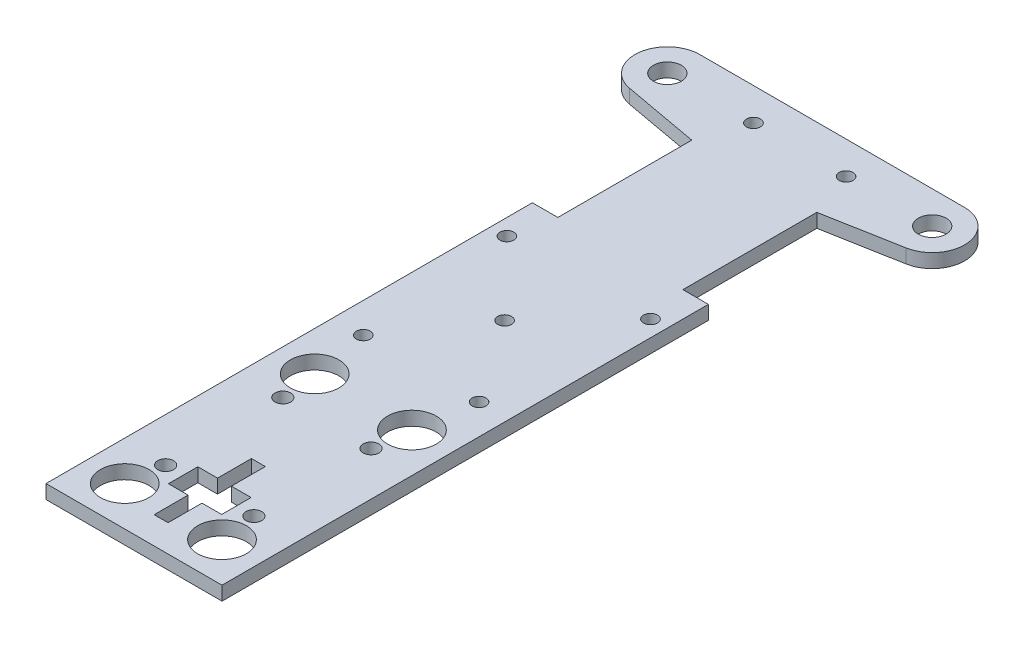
ISO-10303-21;
HEADER;
FILE_DESCRIPTION(('STEP AP214'),'2;1');
FILE_NAME('part.step','',(''),(''),'','','');
FILE_SCHEMA(('AUTOMOTIVE_DESIGN { 1 0 10303 214 1 1 1 1 }'));
ENDSEC;
DATA;
#1=APPLICATION_CONTEXT('core data for automotive mechanical design processes');
#2=APPLICATION_PROTOCOL_DEFINITION('international standard','automotive_design',2000,#1);
#3=PRODUCT_CONTEXT('',#1,'mechanical');
#4=PRODUCT('Part','Part','',(#3));
#5=PRODUCT_RELATED_PRODUCT_CATEGORY('part','',(#4));
#6=PRODUCT_DEFINITION_FORMATION('','',#4);
#7=PRODUCT_DEFINITION_CONTEXT('part definition',#1,'design');
#8=PRODUCT_DEFINITION('design','',#6,#7);
#9=PRODUCT_DEFINITION_SHAPE('','',#8);
#10=(LENGTH_UNIT() NAMED_UNIT(*) SI_UNIT(.MILLI.,.METRE.));
#11=(NAMED_UNIT(*) PLANE_ANGLE_UNIT() SI_UNIT($,.RADIAN.));
#12=(NAMED_UNIT(*) SI_UNIT($,.STERADIAN.) SOLID_ANGLE_UNIT());
#13=UNCERTAINTY_MEASURE_WITH_UNIT(LENGTH_MEASURE(1.E-05),#10,'distance_accuracy_value','');
#14=(GEOMETRIC_REPRESENTATION_CONTEXT(3) GLOBAL_UNCERTAINTY_ASSIGNED_CONTEXT((#13)) GLOBAL_UNIT_ASSIGNED_CONTEXT((#10,
#11,#12)) REPRESENTATION_CONTEXT('',''));
#15=CARTESIAN_POINT('',(0.,0.,0.));
#16=DIRECTION('',(0.,0.,1.));
#17=DIRECTION('',(1.,0.,0.));
#18=AXIS2_PLACEMENT_3D('',#15,#16,#17);
#19=CARTESIAN_POINT('',(0.,0.,-102.));
#20=DIRECTION('',(0.,0.,-1.));
#21=DIRECTION('',(-1.,0.,0.));
#22=AXIS2_PLACEMENT_3D('',#19,#20,#21);
#23=PLANE('',#22);
#24=DIRECTION('',(-1.,0.,0.));
#25=VECTOR('',#24,1.);
#26=CARTESIAN_POINT('',(32.,0.,-102.));
#27=LINE('',#26,#25);
#28=CARTESIAN_POINT('',(35.,0.,-102.));
#29=VERTEX_POINT('',#28);
#30=CARTESIAN_POINT('',(29.5,0.,-102.));
#31=VERTEX_POINT('',#30);
#32=EDGE_CURVE('E447',#29,#31,#27,.T.);
#33=ORIENTED_EDGE('',*,*,#32,.T.);
#34=DIRECTION('',(0.,1.,0.));
#35=VECTOR('',#34,1.);
#36=CARTESIAN_POINT('',(29.5,-36.7967389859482,-102.));
#37=LINE('',#36,#35);
#38=CARTESIAN_POINT('',(29.5,3.,-102.));
#39=VERTEX_POINT('',#38);
#40=EDGE_CURVE('E316',#31,#39,#37,.T.);
#41=ORIENTED_EDGE('',*,*,#40,.T.);
#42=DIRECTION('',(1.,0.,0.));
#43=VECTOR('',#42,1.);
#44=CARTESIAN_POINT('',(0.,3.,-102.));
#45=LINE('',#44,#43);
#46=CARTESIAN_POINT('',(35.,3.,-102.));
#47=VERTEX_POINT('',#46);
#48=EDGE_CURVE('E449',#39,#47,#45,.T.);
#49=ORIENTED_EDGE('',*,*,#48,.T.);
#50=DIRECTION('',(0.,-1.,0.));
#51=VECTOR('',#50,1.);
#52=CARTESIAN_POINT('',(35.,0.,-102.));
#53=LINE('',#52,#51);
#54=EDGE_CURVE('E319',#47,#29,#53,.T.);
#55=ORIENTED_EDGE('',*,*,#54,.T.);
#56=EDGE_LOOP('',(#33,#41,#49,#55));
#57=FACE_BOUND('',#56,.T.);
#58=ADVANCED_FACE('F35',(#57),#23,.T.);
#59=CARTESIAN_POINT('',(10.25,0.,-16.5273947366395));
#60=DIRECTION('',(0.,0.,-1.));
#61=DIRECTION('',(-1.,0.,0.));
#62=AXIS2_PLACEMENT_3D('',#59,#60,#61);
#63=PLANE('',#62);
#64=DIRECTION('',(-1.,0.,0.));
#65=VECTOR('',#64,1.);
#66=CARTESIAN_POINT('',(10.25,0.,-16.5273947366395));
#67=LINE('',#66,#65);
#68=CARTESIAN_POINT('',(14.5,0.,-16.5273947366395));
#69=VERTEX_POINT('',#68);
#70=CARTESIAN_POINT('',(10.25,0.,-16.5273947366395));
#71=VERTEX_POINT('',#70);
#72=EDGE_CURVE('E418',#69,#71,#67,.T.);
#73=ORIENTED_EDGE('',*,*,#72,.F.);
#74=DIRECTION('',(0.,1.,0.));
#75=VECTOR('',#74,1.);
#76=CARTESIAN_POINT('',(14.5,0.,-16.5273947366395));
#77=LINE('',#76,#75);
#78=CARTESIAN_POINT('',(14.5,3.,-16.5273947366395));
#79=VERTEX_POINT('',#78);
#80=EDGE_CURVE('E392',#69,#79,#77,.T.);
#81=ORIENTED_EDGE('',*,*,#80,.T.);
#82=DIRECTION('',(-1.,0.,0.));
#83=VECTOR('',#82,1.);
#84=CARTESIAN_POINT('',(0.,3.,-16.5273947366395));
#85=LINE('',#84,#83);
#86=CARTESIAN_POINT('',(10.25,3.,-16.5273947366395));
#87=VERTEX_POINT('',#86);
#88=EDGE_CURVE('E439',#79,#87,#85,.T.);
#89=ORIENTED_EDGE('',*,*,#88,.T.);
#90=DIRECTION('',(0.,1.,0.));
#91=VECTOR('',#90,1.);
#92=CARTESIAN_POINT('',(10.25,0.,-16.5273947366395));
#93=LINE('',#92,#91);
#94=EDGE_CURVE('E423',#71,#87,#93,.T.);
#95=ORIENTED_EDGE('',*,*,#94,.F.);
#96=EDGE_LOOP('',(#73,#81,#89,#95));
#97=FACE_BOUND('',#96,.T.);
#98=ADVANCED_FACE('F499',(#97),#63,.F.);
#99=CARTESIAN_POINT('',(10.25,0.,-10.1773947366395));
#100=DIRECTION('',(0.,0.,1.));
#101=DIRECTION('',(1.,0.,0.));
#102=AXIS2_PLACEMENT_3D('',#99,#100,#101);
#103=PLANE('',#102);
#104=DIRECTION('',(1.,0.,0.));
#105=VECTOR('',#104,1.);
#106=CARTESIAN_POINT('',(0.,3.,-10.1773947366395));
#107=LINE('',#106,#105);
#108=CARTESIAN_POINT('',(10.25,3.,-10.1773947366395));
#109=VERTEX_POINT('',#108);
#110=CARTESIAN_POINT('',(14.5,3.,-10.1773947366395));
#111=VERTEX_POINT('',#110);
#112=EDGE_CURVE('E434',#109,#111,#107,.T.);
#113=ORIENTED_EDGE('',*,*,#112,.T.);
#114=DIRECTION('',(0.,-1.,0.));
#115=VECTOR('',#114,1.);
#116=CARTESIAN_POINT('',(14.5,0.,-10.1773947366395));
#117=LINE('',#116,#115);
#118=CARTESIAN_POINT('',(14.5,0.,-10.1773947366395));
#119=VERTEX_POINT('',#118);
#120=EDGE_CURVE('E12',#111,#119,#117,.T.);
#121=ORIENTED_EDGE('',*,*,#120,.T.);
#122=DIRECTION('',(1.,0.,0.));
#123=VECTOR('',#122,1.);
#124=CARTESIAN_POINT('',(10.25,0.,-10.1773947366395));
#125=LINE('',#124,#123);
#126=CARTESIAN_POINT('',(10.25,0.,-10.1773947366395));
#127=VERTEX_POINT('',#126);
#128=EDGE_CURVE('E412',#127,#119,#125,.T.);
#129=ORIENTED_EDGE('',*,*,#128,.F.);
#130=DIRECTION('',(0.,1.,0.));
#131=VECTOR('',#130,1.);
#132=CARTESIAN_POINT('',(10.25,0.,-10.1773947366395));
#133=LINE('',#132,#131);
#134=EDGE_CURVE('E422',#127,#109,#133,.T.);
#135=ORIENTED_EDGE('',*,*,#134,.T.);
#136=EDGE_LOOP('',(#113,#121,#129,#135));
#137=FACE_BOUND('',#136,.T.);
#138=ADVANCED_FACE('F489',(#137),#103,.F.);
#139=CARTESIAN_POINT('',(0.,3.,0.));
#140=DIRECTION('',(0.,1.,0.));
#141=DIRECTION('',(0.,0.,1.));
#142=AXIS2_PLACEMENT_3D('',#139,#140,#141);
#143=PLANE('',#142);
#144=CARTESIAN_POINT('',(5.5,3.,-5.50000000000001));
#145=DIRECTION('',(0.,1.,0.));
#146=DIRECTION('',(0.,0.,1.));
#147=AXIS2_PLACEMENT_3D('',#144,#145,#146);
#148=CIRCLE('',#147,5.25);
#149=CARTESIAN_POINT('',(5.5,3.,-0.250000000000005));
#150=VERTEX_POINT('',#149);
#151=EDGE_CURVE('E225',#150,#150,#148,.T.);
#152=ORIENTED_EDGE('',*,*,#151,.F.);
#153=EDGE_LOOP('',(#152));
#154=FACE_BOUND('',#153,.T.);
#155=CARTESIAN_POINT('',(26.5,3.,-5.50000000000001));
#156=DIRECTION('',(0.,1.,0.));
#157=DIRECTION('',(0.,0.,1.));
#158=AXIS2_PLACEMENT_3D('',#155,#156,#157);
#159=CIRCLE('',#158,5.25);
#160=CARTESIAN_POINT('',(26.5,3.,-0.250000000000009));
#161=VERTEX_POINT('',#160);
#162=EDGE_CURVE('E229',#161,#161,#159,.T.);
#163=ORIENTED_EDGE('',*,*,#162,.F.);
#164=EDGE_LOOP('',(#163));
#165=FACE_BOUND('',#164,.T.);
#166=CARTESIAN_POINT('',(26.5,3.,-46.5));
#167=DIRECTION('',(0.,1.,0.));
#168=DIRECTION('',(0.,0.,1.));
#169=AXIS2_PLACEMENT_3D('',#166,#167,#168);
#170=CIRCLE('',#169,5.25);
#171=CARTESIAN_POINT('',(26.5,3.,-41.25));
#172=VERTEX_POINT('',#171);
#173=EDGE_CURVE('E678',#172,#172,#170,.T.);
#174=ORIENTED_EDGE('',*,*,#173,.F.);
#175=EDGE_LOOP('',(#174));
#176=FACE_BOUND('',#175,.T.);
#177=CARTESIAN_POINT('',(5.5,3.,-46.5));
#178=DIRECTION('',(0.,1.,0.));
#179=DIRECTION('',(0.,0.,1.));
#180=AXIS2_PLACEMENT_3D('',#177,#178,#179);
#181=CIRCLE('',#180,5.25);
#182=CARTESIAN_POINT('',(5.5,3.,-41.25));
#183=VERTEX_POINT('',#182);
#184=EDGE_CURVE('E680',#183,#183,#181,.T.);
#185=ORIENTED_EDGE('',*,*,#184,.F.);
#186=EDGE_LOOP('',(#185));
#187=FACE_BOUND('',#186,.T.);
#188=DIRECTION('',(0.,0.,-1.));
#189=VECTOR('',#188,1.);
#190=CARTESIAN_POINT('',(-3.,3.,-102.));
#191=LINE('',#190,#189);
#192=CARTESIAN_POINT('',(-3.,3.,3.));
#193=VERTEX_POINT('',#192);
#194=CARTESIAN_POINT('',(-3.,3.,-102.));
#195=VERTEX_POINT('',#194);
#196=EDGE_CURVE('E212',#193,#195,#191,.T.);
#197=ORIENTED_EDGE('',*,*,#196,.F.);
#198=DIRECTION('',(1.,0.,0.));
#199=VECTOR('',#198,1.);
#200=CARTESIAN_POINT('',(35.,3.,3.));
#201=LINE('',#200,#199);
#202=CARTESIAN_POINT('',(35.,3.,3.));
#203=VERTEX_POINT('',#202);
#204=EDGE_CURVE('E198',#193,#203,#201,.T.);
#205=ORIENTED_EDGE('',*,*,#204,.T.);
#206=DIRECTION('',(0.,0.,-1.));
#207=VECTOR('',#206,1.);
#208=CARTESIAN_POINT('',(35.,3.,-102.));
#209=LINE('',#208,#207);
#210=EDGE_CURVE('E328',#203,#47,#209,.T.);
#211=ORIENTED_EDGE('',*,*,#210,.T.);
#212=ORIENTED_EDGE('',*,*,#48,.F.);
#213=DIRECTION('',(0.,0.,-1.));
#214=VECTOR('',#213,1.);
#215=CARTESIAN_POINT('',(29.5,3.,-102.));
#216=LINE('',#215,#214);
#217=CARTESIAN_POINT('',(29.5,3.,-130.910855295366));
#218=VERTEX_POINT('',#217);
#219=EDGE_CURVE('E321',#39,#218,#216,.T.);
#220=ORIENTED_EDGE('',*,*,#219,.T.);
#221=DIRECTION('',(0.983652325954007,0.,-0.180078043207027));
#222=VECTOR('',#221,1.);
#223=CARTESIAN_POINT('',(29.5,3.,-130.910855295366));
#224=LINE('',#223,#222);
#225=CARTESIAN_POINT('',(45.7980576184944,3.,-133.894554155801));
#226=VERTEX_POINT('',#225);
#227=EDGE_CURVE('E263',#218,#226,#224,.T.);
#228=ORIENTED_EDGE('',*,*,#227,.T.);
#229=CARTESIAN_POINT('',(44.5375112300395,3.,-140.780120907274));
#230=DIRECTION('',(0.,1.,0.));
#231=DIRECTION('',(0.,0.,1.));
#232=AXIS2_PLACEMENT_3D('',#229,#230,#231);
#233=CIRCLE('',#232,7.00000047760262);
#234=CARTESIAN_POINT('',(44.5375112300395,3.,-147.780121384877));
#235=VERTEX_POINT('',#234);
#236=EDGE_CURVE('E266',#226,#235,#233,.T.);
#237=ORIENTED_EDGE('',*,*,#236,.T.);
#238=DIRECTION('',(-1.,0.,0.));
#239=VECTOR('',#238,1.);
#240=CARTESIAN_POINT('',(-12.6398663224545,3.,-147.780121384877));
#241=LINE('',#240,#239);
#242=CARTESIAN_POINT('',(-12.6398663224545,3.,-147.780121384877));
#243=VERTEX_POINT('',#242);
#244=EDGE_CURVE('E269',#235,#243,#241,.T.);
#245=ORIENTED_EDGE('',*,*,#244,.T.);
#246=CARTESIAN_POINT('',(-12.6398663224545,3.,-140.780121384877));
#247=DIRECTION('',(0.,1.,0.));
#248=DIRECTION('',(0.,0.,1.));
#249=AXIS2_PLACEMENT_3D('',#246,#247,#248);
#250=CIRCLE('',#249,7.00000000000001);
#251=CARTESIAN_POINT('',(-13.892796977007,3.,-133.893165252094));
#252=VERTEX_POINT('',#251);
#253=EDGE_CURVE('E245',#243,#252,#250,.T.);
#254=ORIENTED_EDGE('',*,*,#253,.T.);
#255=DIRECTION('',(0.983850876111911,0.,0.178990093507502));
#256=VECTOR('',#255,1.);
#257=CARTESIAN_POINT('',(-13.892796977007,3.,-133.893165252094));
#258=LINE('',#257,#256);
#259=CARTESIAN_POINT('',(2.5,3.,-130.910855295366));
#260=VERTEX_POINT('',#259);
#261=EDGE_CURVE('E260',#252,#260,#258,.T.);
#262=ORIENTED_EDGE('',*,*,#261,.T.);
#263=DIRECTION('',(0.,0.,1.));
#264=VECTOR('',#263,1.);
#265=CARTESIAN_POINT('',(2.5,3.,-102.));
#266=LINE('',#265,#264);
#267=CARTESIAN_POINT('',(2.5,3.,-102.));
#268=VERTEX_POINT('',#267);
#269=EDGE_CURVE('E311',#260,#268,#266,.T.);
#270=ORIENTED_EDGE('',*,*,#269,.T.);
#271=EDGE_CURVE('E215',#195,#268,#45,.T.);
#272=ORIENTED_EDGE('',*,*,#271,.F.);
#273=EDGE_LOOP('',(#197,#205,#211,#212,#220,#228,#237,#245,#254,#262,#270,#272));
#274=FACE_BOUND('',#273,.T.);
#275=CARTESIAN_POINT('',(5.94991125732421,3.,-140.780133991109));
#276=DIRECTION('',(0.,1.,0.));
#277=DIRECTION('',(0.,0.,1.));
#278=AXIS2_PLACEMENT_3D('',#275,#276,#277);
#279=CIRCLE('',#278,1.5);
#280=CARTESIAN_POINT('',(5.94991125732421,3.,-139.280133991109));
#281=VERTEX_POINT('',#280);
#282=EDGE_CURVE('E242',#281,#281,#279,.T.);
#283=ORIENTED_EDGE('',*,*,#282,.F.);
#284=EDGE_LOOP('',(#283));
#285=FACE_BOUND('',#284,.T.);
#286=CARTESIAN_POINT('',(25.9499112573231,3.,-140.780127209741));
#287=DIRECTION('',(0.,1.,0.));
#288=DIRECTION('',(0.,0.,1.));
#289=AXIS2_PLACEMENT_3D('',#286,#287,#288);
#290=CIRCLE('',#289,1.49999999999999);
#291=CARTESIAN_POINT('',(25.9499112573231,3.,-139.280127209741));
#292=VERTEX_POINT('',#291);
#293=EDGE_CURVE('E237',#292,#292,#290,.T.);
#294=ORIENTED_EDGE('',*,*,#293,.F.);
#295=EDGE_LOOP('',(#294));
#296=FACE_BOUND('',#295,.T.);
#297=CARTESIAN_POINT('',(31.5,3.,-93.));
#298=DIRECTION('',(0.,1.,0.));
#299=DIRECTION('',(0.,0.,1.));
#300=AXIS2_PLACEMENT_3D('',#297,#298,#299);
#301=CIRCLE('',#300,1.5);
#302=CARTESIAN_POINT('',(31.5,3.,-91.5));
#303=VERTEX_POINT('',#302);
#304=EDGE_CURVE('E298',#303,#303,#301,.T.);
#305=ORIENTED_EDGE('',*,*,#304,.F.);
#306=EDGE_LOOP('',(#305));
#307=FACE_BOUND('',#306,.T.);
#308=CARTESIAN_POINT('',(16.,3.,-77.));
#309=DIRECTION('',(0.,1.,0.));
#310=DIRECTION('',(0.,0.,1.));
#311=AXIS2_PLACEMENT_3D('',#308,#309,#310);
#312=CIRCLE('',#311,1.5);
#313=CARTESIAN_POINT('',(16.,3.,-75.5));
#314=VERTEX_POINT('',#313);
#315=EDGE_CURVE('E295',#314,#314,#312,.T.);
#316=ORIENTED_EDGE('',*,*,#315,.F.);
#317=EDGE_LOOP('',(#316));
#318=FACE_BOUND('',#317,.T.);
#319=CARTESIAN_POINT('',(0.5,3.,-93.));
#320=DIRECTION('',(0.,1.,0.));
#321=DIRECTION('',(0.,0.,1.));
#322=AXIS2_PLACEMENT_3D('',#319,#320,#321);
#323=CIRCLE('',#322,1.50000000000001);
#324=CARTESIAN_POINT('',(0.5,3.,-91.5));
#325=VERTEX_POINT('',#324);
#326=EDGE_CURVE('E287',#325,#325,#323,.T.);
#327=ORIENTED_EDGE('',*,*,#326,.F.);
#328=EDGE_LOOP('',(#327));
#329=FACE_BOUND('',#328,.T.);
#330=CARTESIAN_POINT('',(3.5,3.,-59.));
#331=DIRECTION('',(0.,1.,0.));
#332=DIRECTION('',(0.,0.,1.));
#333=AXIS2_PLACEMENT_3D('',#330,#331,#332);
#334=CIRCLE('',#333,1.5);
#335=CARTESIAN_POINT('',(3.5,3.,-57.5));
#336=VERTEX_POINT('',#335);
#337=EDGE_CURVE('E343',#336,#336,#334,.T.);
#338=ORIENTED_EDGE('',*,*,#337,.F.);
#339=EDGE_LOOP('',(#338));
#340=FACE_BOUND('',#339,.T.);
#341=CARTESIAN_POINT('',(28.5,3.,-59.));
#342=DIRECTION('',(0.,1.,0.));
#343=DIRECTION('',(0.,0.,1.));
#344=AXIS2_PLACEMENT_3D('',#341,#342,#343);
#345=CIRCLE('',#344,1.5);
#346=CARTESIAN_POINT('',(28.5,3.,-57.5));
#347=VERTEX_POINT('',#346);
#348=EDGE_CURVE('E338',#347,#347,#345,.T.);
#349=ORIENTED_EDGE('',*,*,#348,.F.);
#350=EDGE_LOOP('',(#349));
#351=FACE_BOUND('',#350,.T.);
#352=CARTESIAN_POINT('',(25.525,3.,-38.6476052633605));
#353=DIRECTION('',(0.,1.,0.));
#354=DIRECTION('',(0.,0.,1.));
#355=AXIS2_PLACEMENT_3D('',#352,#353,#354);
#356=CIRCLE('',#355,1.69999999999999);
#357=CARTESIAN_POINT('',(25.525,3.,-36.9476052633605));
#358=VERTEX_POINT('',#357);
#359=EDGE_CURVE('E355',#358,#358,#356,.T.);
#360=ORIENTED_EDGE('',*,*,#359,.F.);
#361=EDGE_LOOP('',(#360));
#362=FACE_BOUND('',#361,.T.);
#363=CARTESIAN_POINT('',(6.47499999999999,3.,-38.6476052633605));
#364=DIRECTION('',(0.,1.,0.));
#365=DIRECTION('',(0.,0.,1.));
#366=AXIS2_PLACEMENT_3D('',#363,#364,#365);
#367=CIRCLE('',#366,1.69999999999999);
#368=CARTESIAN_POINT('',(6.47499999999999,3.,-36.9476052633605));
#369=VERTEX_POINT('',#368);
#370=EDGE_CURVE('E352',#369,#369,#367,.T.);
#371=ORIENTED_EDGE('',*,*,#370,.F.);
#372=EDGE_LOOP('',(#371));
#373=FACE_BOUND('',#372,.T.);
#374=DIRECTION('',(0.,0.,1.));
#375=VECTOR('',#374,1.);
#376=CARTESIAN_POINT('',(14.5,3.,0.));
#377=LINE('',#376,#375);
#378=CARTESIAN_POINT('',(14.5,3.,-23.8523947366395));
#379=VERTEX_POINT('',#378);
#380=EDGE_CURVE('E393',#379,#79,#377,.T.);
#381=ORIENTED_EDGE('',*,*,#380,.F.);
#382=DIRECTION('',(-1.,0.,0.));
#383=VECTOR('',#382,1.);
#384=CARTESIAN_POINT('',(0.,3.,-23.8523947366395));
#385=LINE('',#384,#383);
#386=CARTESIAN_POINT('',(17.5,3.,-23.8523947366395));
#387=VERTEX_POINT('',#386);
#388=EDGE_CURVE('E398',#387,#379,#385,.T.);
#389=ORIENTED_EDGE('',*,*,#388,.F.);
#390=DIRECTION('',(0.,0.,-1.));
#391=VECTOR('',#390,1.);
#392=CARTESIAN_POINT('',(17.5,3.,0.));
#393=LINE('',#392,#391);
#394=CARTESIAN_POINT('',(17.5,3.,-16.5273947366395));
#395=VERTEX_POINT('',#394);
#396=EDGE_CURVE('E387',#395,#387,#393,.T.);
#397=ORIENTED_EDGE('',*,*,#396,.F.);
#398=CARTESIAN_POINT('',(21.75,3.,-16.5273947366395));
#399=VERTEX_POINT('',#398);
#400=EDGE_CURVE('E440',#399,#395,#85,.T.);
#401=ORIENTED_EDGE('',*,*,#400,.F.);
#402=DIRECTION('',(0.,0.,-1.));
#403=VECTOR('',#402,1.);
#404=CARTESIAN_POINT('',(21.75,3.,0.));
#405=LINE('',#404,#403);
#406=CARTESIAN_POINT('',(21.75,3.,-10.1773947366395));
#407=VERTEX_POINT('',#406);
#408=EDGE_CURVE('E437',#407,#399,#405,.T.);
#409=ORIENTED_EDGE('',*,*,#408,.F.);
#410=CARTESIAN_POINT('',(17.5,3.,-10.1773947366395));
#411=VERTEX_POINT('',#410);
#412=EDGE_CURVE('E426',#411,#407,#107,.T.);
#413=ORIENTED_EDGE('',*,*,#412,.F.);
#414=CARTESIAN_POINT('',(17.5,3.,-2.85239473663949));
#415=VERTEX_POINT('',#414);
#416=EDGE_CURVE('E376',#415,#411,#393,.T.);
#417=ORIENTED_EDGE('',*,*,#416,.F.);
#418=DIRECTION('',(1.,0.,0.));
#419=VECTOR('',#418,1.);
#420=CARTESIAN_POINT('',(0.,3.,-2.85239473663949));
#421=LINE('',#420,#419);
#422=CARTESIAN_POINT('',(14.5,3.,-2.85239473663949));
#423=VERTEX_POINT('',#422);
#424=EDGE_CURVE('E396',#423,#415,#421,.T.);
#425=ORIENTED_EDGE('',*,*,#424,.F.);
#426=EDGE_CURVE('E390',#111,#423,#377,.T.);
#427=ORIENTED_EDGE('',*,*,#426,.F.);
#428=ORIENTED_EDGE('',*,*,#112,.F.);
#429=DIRECTION('',(0.,0.,1.));
#430=VECTOR('',#429,1.);
#431=CARTESIAN_POINT('',(10.25,3.,0.));
#432=LINE('',#431,#430);
#433=EDGE_CURVE('E443',#87,#109,#432,.T.);
#434=ORIENTED_EDGE('',*,*,#433,.F.);
#435=ORIENTED_EDGE('',*,*,#88,.F.);
#436=EDGE_LOOP('',(#381,#389,#397,#401,#409,#413,#417,#425,#427,#428,#434,#435));
#437=FACE_BOUND('',#436,.T.);
#438=CARTESIAN_POINT('',(25.525,3.,-13.3523947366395));
#439=DIRECTION('',(0.,-1.,0.));
#440=DIRECTION('',(0.,0.,-1.));
#441=AXIS2_PLACEMENT_3D('',#438,#439,#440);
#442=CIRCLE('',#441,1.69999999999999);
#443=CARTESIAN_POINT('',(25.525,3.,-15.0523947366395));
#444=VERTEX_POINT('',#443);
#445=EDGE_CURVE('E401',#444,#444,#442,.T.);
#446=ORIENTED_EDGE('',*,*,#445,.T.);
#447=EDGE_LOOP('',(#446));
#448=FACE_BOUND('',#447,.T.);
#449=CARTESIAN_POINT('',(6.47499999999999,3.,-13.3523947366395));
#450=DIRECTION('',(0.,-1.,0.));
#451=DIRECTION('',(0.,0.,-1.));
#452=AXIS2_PLACEMENT_3D('',#449,#450,#451);
#453=CIRCLE('',#452,1.69999999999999);
#454=CARTESIAN_POINT('',(6.47499999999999,3.,-15.0523947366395));
#455=VERTEX_POINT('',#454);
#456=EDGE_CURVE('E400',#455,#455,#453,.T.);
#457=ORIENTED_EDGE('',*,*,#456,.T.);
#458=EDGE_LOOP('',(#457));
#459=FACE_BOUND('',#458,.T.);
#460=CARTESIAN_POINT('',(-12.6398663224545,3.,-140.780121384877));
#461=DIRECTION('',(0.,1.,0.));
#462=DIRECTION('',(0.,0.,1.));
#463=AXIS2_PLACEMENT_3D('',#460,#461,#462);
#464=CIRCLE('',#463,3.00000000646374);
#465=CARTESIAN_POINT('',(-12.6398663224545,3.,-137.780121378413));
#466=VERTEX_POINT('',#465);
#467=EDGE_CURVE('E308',#466,#466,#464,.F.);
#468=ORIENTED_EDGE('',*,*,#467,.T.);
#469=EDGE_LOOP('',(#468));
#470=FACE_BOUND('',#469,.T.);
#471=CARTESIAN_POINT('',(44.5375112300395,3.,-140.780120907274));
#472=DIRECTION('',(0.,1.,0.));
#473=DIRECTION('',(0.,0.,1.));
#474=AXIS2_PLACEMENT_3D('',#471,#472,#473);
#475=CIRCLE('',#474,3.00000000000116);
#476=CARTESIAN_POINT('',(44.5375112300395,3.,-137.780120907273));
#477=VERTEX_POINT('',#476);
#478=EDGE_CURVE('E307',#477,#477,#475,.F.);
#479=ORIENTED_EDGE('',*,*,#478,.T.);
#480=EDGE_LOOP('',(#479));
#481=FACE_BOUND('',#480,.T.);
#482=ADVANCED_FACE('F213',(#154,#165,#176,#187,#274,#285,#296,#307,#318,#329,#340,#351,#362,
#373,#437,#448,#459,#470,#481),#143,.T.);
#483=CARTESIAN_POINT('',(0.,0.,0.));
#484=DIRECTION('',(0.,1.,0.));
#485=DIRECTION('',(0.,0.,1.));
#486=AXIS2_PLACEMENT_3D('',#483,#484,#485);
#487=PLANE('',#486);
#488=CARTESIAN_POINT('',(5.5,0.,-5.50000000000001));
#489=DIRECTION('',(0.,1.,0.));
#490=DIRECTION('',(0.,0.,1.));
#491=AXIS2_PLACEMENT_3D('',#488,#489,#490);
#492=CIRCLE('',#491,5.25);
#493=CARTESIAN_POINT('',(5.5,0.,-0.250000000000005));
#494=VERTEX_POINT('',#493);
#495=EDGE_CURVE('E545',#494,#494,#492,.T.);
#496=ORIENTED_EDGE('',*,*,#495,.T.);
#497=EDGE_LOOP('',(#496));
#498=FACE_BOUND('',#497,.T.);
#499=CARTESIAN_POINT('',(26.5,0.,-5.50000000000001));
#500=DIRECTION('',(0.,1.,0.));
#501=DIRECTION('',(0.,0.,1.));
#502=AXIS2_PLACEMENT_3D('',#499,#500,#501);
#503=CIRCLE('',#502,5.25);
#504=CARTESIAN_POINT('',(26.5,0.,-0.250000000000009));
#505=VERTEX_POINT('',#504);
#506=EDGE_CURVE('E549',#505,#505,#503,.T.);
#507=ORIENTED_EDGE('',*,*,#506,.T.);
#508=EDGE_LOOP('',(#507));
#509=FACE_BOUND('',#508,.T.);
#510=CARTESIAN_POINT('',(26.5,0.,-46.5));
#511=DIRECTION('',(0.,1.,0.));
#512=DIRECTION('',(0.,0.,1.));
#513=AXIS2_PLACEMENT_3D('',#510,#511,#512);
#514=CIRCLE('',#513,5.25);
#515=CARTESIAN_POINT('',(26.5,0.,-41.25));
#516=VERTEX_POINT('',#515);
#517=EDGE_CURVE('E553',#516,#516,#514,.T.);
#518=ORIENTED_EDGE('',*,*,#517,.T.);
#519=EDGE_LOOP('',(#518));
#520=FACE_BOUND('',#519,.T.);
#521=CARTESIAN_POINT('',(5.5,0.,-46.5));
#522=DIRECTION('',(0.,1.,0.));
#523=DIRECTION('',(0.,0.,1.));
#524=AXIS2_PLACEMENT_3D('',#521,#522,#523);
#525=CIRCLE('',#524,5.25);
#526=CARTESIAN_POINT('',(5.5,0.,-41.25));
#527=VERTEX_POINT('',#526);
#528=EDGE_CURVE('E556',#527,#527,#525,.T.);
#529=ORIENTED_EDGE('',*,*,#528,.T.);
#530=EDGE_LOOP('',(#529));
#531=FACE_BOUND('',#530,.T.);
#532=DIRECTION('',(-1.,0.,0.));
#533=VECTOR('',#532,1.);
#534=CARTESIAN_POINT('',(32.,0.,3.));
#535=LINE('',#534,#533);
#536=CARTESIAN_POINT('',(35.,0.,3.));
#537=VERTEX_POINT('',#536);
#538=CARTESIAN_POINT('',(-3.,0.,3.));
#539=VERTEX_POINT('',#538);
#540=EDGE_CURVE('E209',#537,#539,#535,.T.);
#541=ORIENTED_EDGE('',*,*,#540,.T.);
#542=DIRECTION('',(0.,0.,1.));
#543=VECTOR('',#542,1.);
#544=CARTESIAN_POINT('',(-3.,0.,-102.));
#545=LINE('',#544,#543);
#546=CARTESIAN_POINT('',(-3.,0.,-102.));
#547=VERTEX_POINT('',#546);
#548=EDGE_CURVE('E220',#547,#539,#545,.T.);
#549=ORIENTED_EDGE('',*,*,#548,.F.);
#550=CARTESIAN_POINT('',(2.5,0.,-102.));
#551=VERTEX_POINT('',#550);
#552=EDGE_CURVE('E446',#551,#547,#27,.T.);
#553=ORIENTED_EDGE('',*,*,#552,.F.);
#554=DIRECTION('',(0.,0.,-1.));
#555=VECTOR('',#554,1.);
#556=CARTESIAN_POINT('',(2.5,0.,-102.));
#557=LINE('',#556,#555);
#558=CARTESIAN_POINT('',(2.5,0.,-130.910855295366));
#559=VERTEX_POINT('',#558);
#560=EDGE_CURVE('E315',#551,#559,#557,.T.);
#561=ORIENTED_EDGE('',*,*,#560,.T.);
#562=DIRECTION('',(-0.983850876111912,0.,-0.178990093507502));
#563=VECTOR('',#562,1.);
#564=CARTESIAN_POINT('',(-13.892796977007,0.,-133.893165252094));
#565=LINE('',#564,#563);
#566=CARTESIAN_POINT('',(-13.892796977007,0.,-133.893165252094));
#567=VERTEX_POINT('',#566);
#568=EDGE_CURVE('E246',#559,#567,#565,.T.);
#569=ORIENTED_EDGE('',*,*,#568,.T.);
#570=CARTESIAN_POINT('',(-12.6398663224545,0.,-140.780121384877));
#571=DIRECTION('',(0.,1.,0.));
#572=DIRECTION('',(0.,0.,1.));
#573=AXIS2_PLACEMENT_3D('',#570,#571,#572);
#574=CIRCLE('',#573,7.00000000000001);
#575=CARTESIAN_POINT('',(-12.6398663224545,0.,-147.780121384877));
#576=VERTEX_POINT('',#575);
#577=EDGE_CURVE('E249',#567,#576,#574,.F.);
#578=ORIENTED_EDGE('',*,*,#577,.T.);
#579=DIRECTION('',(1.,0.,0.));
#580=VECTOR('',#579,1.);
#581=CARTESIAN_POINT('',(-12.6398663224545,0.,-147.780121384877));
#582=LINE('',#581,#580);
#583=CARTESIAN_POINT('',(44.5375112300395,0.,-147.780121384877));
#584=VERTEX_POINT('',#583);
#585=EDGE_CURVE('E255',#576,#584,#582,.T.);
#586=ORIENTED_EDGE('',*,*,#585,.T.);
#587=CARTESIAN_POINT('',(44.5375112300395,0.,-140.780120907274));
#588=DIRECTION('',(0.,1.,0.));
#589=DIRECTION('',(0.,0.,1.));
#590=AXIS2_PLACEMENT_3D('',#587,#588,#589);
#591=CIRCLE('',#590,7.00000047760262);
#592=CARTESIAN_POINT('',(45.7980576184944,0.,-133.894554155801));
#593=VERTEX_POINT('',#592);
#594=EDGE_CURVE('E252',#584,#593,#591,.F.);
#595=ORIENTED_EDGE('',*,*,#594,.T.);
#596=DIRECTION('',(-0.983652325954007,0.,0.180078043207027));
#597=VECTOR('',#596,1.);
#598=CARTESIAN_POINT('',(29.5,0.,-130.910855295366));
#599=LINE('',#598,#597);
#600=CARTESIAN_POINT('',(29.5,0.,-130.910855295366));
#601=VERTEX_POINT('',#600);
#602=EDGE_CURVE('E250',#593,#601,#599,.T.);
#603=ORIENTED_EDGE('',*,*,#602,.T.);
#604=DIRECTION('',(0.,0.,1.));
#605=VECTOR('',#604,1.);
#606=CARTESIAN_POINT('',(29.5,0.,-102.));
#607=LINE('',#606,#605);
#608=EDGE_CURVE('E58',#601,#31,#607,.T.);
#609=ORIENTED_EDGE('',*,*,#608,.T.);
#610=ORIENTED_EDGE('',*,*,#32,.F.);
#611=DIRECTION('',(0.,0.,1.));
#612=VECTOR('',#611,1.);
#613=CARTESIAN_POINT('',(35.,0.,-102.));
#614=LINE('',#613,#612);
#615=EDGE_CURVE('E330',#29,#537,#614,.T.);
#616=ORIENTED_EDGE('',*,*,#615,.T.);
#617=EDGE_LOOP('',(#541,#549,#553,#561,#569,#578,#586,#595,#603,#609,#610,#616));
#618=FACE_BOUND('',#617,.T.);
#619=CARTESIAN_POINT('',(5.94991125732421,0.,-140.780133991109));
#620=DIRECTION('',(0.,1.,0.));
#621=DIRECTION('',(0.,0.,1.));
#622=AXIS2_PLACEMENT_3D('',#619,#620,#621);
#623=CIRCLE('',#622,1.5);
#624=CARTESIAN_POINT('',(5.94991125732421,0.,-139.280133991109));
#625=VERTEX_POINT('',#624);
#626=EDGE_CURVE('E234',#625,#625,#623,.T.);
#627=ORIENTED_EDGE('',*,*,#626,.T.);
#628=EDGE_LOOP('',(#627));
#629=FACE_BOUND('',#628,.T.);
#630=CARTESIAN_POINT('',(25.9499112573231,0.,-140.780127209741));
#631=DIRECTION('',(0.,1.,0.));
#632=DIRECTION('',(0.,0.,1.));
#633=AXIS2_PLACEMENT_3D('',#630,#631,#632);
#634=CIRCLE('',#633,1.49999999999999);
#635=CARTESIAN_POINT('',(25.9499112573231,0.,-139.280127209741));
#636=VERTEX_POINT('',#635);
#637=EDGE_CURVE('E208',#636,#636,#634,.T.);
#638=ORIENTED_EDGE('',*,*,#637,.T.);
#639=EDGE_LOOP('',(#638));
#640=FACE_BOUND('',#639,.T.);
#641=CARTESIAN_POINT('',(31.5,0.,-93.));
#642=DIRECTION('',(0.,1.,0.));
#643=DIRECTION('',(0.,0.,1.));
#644=AXIS2_PLACEMENT_3D('',#641,#642,#643);
#645=CIRCLE('',#644,1.5);
#646=CARTESIAN_POINT('',(31.5,0.,-91.5));
#647=VERTEX_POINT('',#646);
#648=EDGE_CURVE('E284',#647,#647,#645,.T.);
#649=ORIENTED_EDGE('',*,*,#648,.T.);
#650=EDGE_LOOP('',(#649));
#651=FACE_BOUND('',#650,.T.);
#652=CARTESIAN_POINT('',(16.,0.,-77.));
#653=DIRECTION('',(0.,1.,0.));
#654=DIRECTION('',(0.,0.,1.));
#655=AXIS2_PLACEMENT_3D('',#652,#653,#654);
#656=CIRCLE('',#655,1.5);
#657=CARTESIAN_POINT('',(16.,0.,-75.5));
#658=VERTEX_POINT('',#657);
#659=EDGE_CURVE('E288',#658,#658,#656,.T.);
#660=ORIENTED_EDGE('',*,*,#659,.T.);
#661=EDGE_LOOP('',(#660));
#662=FACE_BOUND('',#661,.T.);
#663=CARTESIAN_POINT('',(0.5,0.,-93.));
#664=DIRECTION('',(0.,1.,0.));
#665=DIRECTION('',(0.,0.,1.));
#666=AXIS2_PLACEMENT_3D('',#663,#664,#665);
#667=CIRCLE('',#666,1.50000000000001);
#668=CARTESIAN_POINT('',(0.5,0.,-91.5));
#669=VERTEX_POINT('',#668);
#670=EDGE_CURVE('E248',#669,#669,#667,.T.);
#671=ORIENTED_EDGE('',*,*,#670,.T.);
#672=EDGE_LOOP('',(#671));
#673=FACE_BOUND('',#672,.T.);
#674=CARTESIAN_POINT('',(3.5,0.,-59.));
#675=DIRECTION('',(0.,1.,0.));
#676=DIRECTION('',(0.,0.,1.));
#677=AXIS2_PLACEMENT_3D('',#674,#675,#676);
#678=CIRCLE('',#677,1.5);
#679=CARTESIAN_POINT('',(3.5,0.,-57.5));
#680=VERTEX_POINT('',#679);
#681=EDGE_CURVE('E335',#680,#680,#678,.T.);
#682=ORIENTED_EDGE('',*,*,#681,.T.);
#683=EDGE_LOOP('',(#682));
#684=FACE_BOUND('',#683,.T.);
#685=CARTESIAN_POINT('',(28.5,0.,-59.));
#686=DIRECTION('',(0.,1.,0.));
#687=DIRECTION('',(0.,0.,1.));
#688=AXIS2_PLACEMENT_3D('',#685,#686,#687);
#689=CIRCLE('',#688,1.5);
#690=CARTESIAN_POINT('',(28.5,0.,-57.5));
#691=VERTEX_POINT('',#690);
#692=EDGE_CURVE('E219',#691,#691,#689,.T.);
#693=ORIENTED_EDGE('',*,*,#692,.T.);
#694=EDGE_LOOP('',(#693));
#695=FACE_BOUND('',#694,.T.);
#696=CARTESIAN_POINT('',(25.525,0.,-38.6476052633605));
#697=DIRECTION('',(0.,1.,0.));
#698=DIRECTION('',(0.,0.,-1.));
#699=AXIS2_PLACEMENT_3D('',#696,#697,#698);
#700=CIRCLE('',#699,1.69999999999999);
#701=CARTESIAN_POINT('',(25.525,0.,-40.3476052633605));
#702=VERTEX_POINT('',#701);
#703=EDGE_CURVE('E349',#702,#702,#700,.T.);
#704=ORIENTED_EDGE('',*,*,#703,.T.);
#705=EDGE_LOOP('',(#704));
#706=FACE_BOUND('',#705,.T.);
#707=CARTESIAN_POINT('',(6.47499999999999,0.,-38.6476052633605));
#708=DIRECTION('',(0.,1.,0.));
#709=DIRECTION('',(0.,0.,-1.));
#710=AXIS2_PLACEMENT_3D('',#707,#708,#709);
#711=CIRCLE('',#710,1.69999999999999);
#712=CARTESIAN_POINT('',(6.47499999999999,0.,-40.3476052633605));
#713=VERTEX_POINT('',#712);
#714=EDGE_CURVE('E346',#713,#713,#711,.T.);
#715=ORIENTED_EDGE('',*,*,#714,.T.);
#716=EDGE_LOOP('',(#715));
#717=FACE_BOUND('',#716,.T.);
#718=DIRECTION('',(-1.,0.,0.));
#719=VECTOR('',#718,1.);
#720=CARTESIAN_POINT('',(17.5,0.,-23.8523947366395));
#721=LINE('',#720,#719);
#722=CARTESIAN_POINT('',(17.5,0.,-23.8523947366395));
#723=VERTEX_POINT('',#722);
#724=CARTESIAN_POINT('',(14.5,0.,-23.8523947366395));
#725=VERTEX_POINT('',#724);
#726=EDGE_CURVE('E369',#723,#725,#721,.T.);
#727=ORIENTED_EDGE('',*,*,#726,.T.);
#728=DIRECTION('',(0.,0.,1.));
#729=VECTOR('',#728,1.);
#730=CARTESIAN_POINT('',(14.5,0.,-2.85239473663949));
#731=LINE('',#730,#729);
#732=EDGE_CURVE('E359',#725,#69,#731,.T.);
#733=ORIENTED_EDGE('',*,*,#732,.T.);
#734=ORIENTED_EDGE('',*,*,#72,.T.);
#735=DIRECTION('',(0.,0.,1.));
#736=VECTOR('',#735,1.);
#737=CARTESIAN_POINT('',(10.25,0.,-16.5273947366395));
#738=LINE('',#737,#736);
#739=EDGE_CURVE('E407',#71,#127,#738,.T.);
#740=ORIENTED_EDGE('',*,*,#739,.T.);
#741=ORIENTED_EDGE('',*,*,#128,.T.);
#742=CARTESIAN_POINT('',(14.5,0.,-2.85239473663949));
#743=VERTEX_POINT('',#742);
#744=EDGE_CURVE('E358',#119,#743,#731,.T.);
#745=ORIENTED_EDGE('',*,*,#744,.T.);
#746=DIRECTION('',(1.,0.,0.));
#747=VECTOR('',#746,1.);
#748=CARTESIAN_POINT('',(17.5,0.,-2.85239473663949));
#749=LINE('',#748,#747);
#750=CARTESIAN_POINT('',(17.5,0.,-2.85239473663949));
#751=VERTEX_POINT('',#750);
#752=EDGE_CURVE('E362',#743,#751,#749,.T.);
#753=ORIENTED_EDGE('',*,*,#752,.T.);
#754=DIRECTION('',(0.,0.,-1.));
#755=VECTOR('',#754,1.);
#756=CARTESIAN_POINT('',(17.5,0.,-2.85239473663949));
#757=LINE('',#756,#755);
#758=CARTESIAN_POINT('',(17.5,0.,-10.1773947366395));
#759=VERTEX_POINT('',#758);
#760=EDGE_CURVE('E366',#751,#759,#757,.T.);
#761=ORIENTED_EDGE('',*,*,#760,.T.);
#762=CARTESIAN_POINT('',(21.75,0.,-10.1773947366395));
#763=VERTEX_POINT('',#762);
#764=EDGE_CURVE('E410',#759,#763,#125,.T.);
#765=ORIENTED_EDGE('',*,*,#764,.T.);
#766=DIRECTION('',(0.,0.,-1.));
#767=VECTOR('',#766,1.);
#768=CARTESIAN_POINT('',(21.75,0.,-16.5273947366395));
#769=LINE('',#768,#767);
#770=CARTESIAN_POINT('',(21.75,0.,-16.5273947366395));
#771=VERTEX_POINT('',#770);
#772=EDGE_CURVE('E415',#763,#771,#769,.T.);
#773=ORIENTED_EDGE('',*,*,#772,.T.);
#774=CARTESIAN_POINT('',(17.5,0.,-16.5273947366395));
#775=VERTEX_POINT('',#774);
#776=EDGE_CURVE('E419',#771,#775,#67,.T.);
#777=ORIENTED_EDGE('',*,*,#776,.T.);
#778=EDGE_CURVE('E365',#775,#723,#757,.T.);
#779=ORIENTED_EDGE('',*,*,#778,.T.);
#780=EDGE_LOOP('',(#727,#733,#734,#740,#741,#745,#753,#761,#765,#773,#777,#779));
#781=FACE_BOUND('',#780,.T.);
#782=CARTESIAN_POINT('',(25.525,0.,-13.3523947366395));
#783=DIRECTION('',(0.,1.,0.));
#784=DIRECTION('',(0.,0.,1.));
#785=AXIS2_PLACEMENT_3D('',#782,#783,#784);
#786=CIRCLE('',#785,1.69999999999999);
#787=CARTESIAN_POINT('',(25.525,0.,-11.6523947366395));
#788=VERTEX_POINT('',#787);
#789=EDGE_CURVE('E411',#788,#788,#786,.T.);
#790=ORIENTED_EDGE('',*,*,#789,.T.);
#791=EDGE_LOOP('',(#790));
#792=FACE_BOUND('',#791,.T.);
#793=CARTESIAN_POINT('',(6.47499999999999,0.,-13.3523947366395));
#794=DIRECTION('',(0.,1.,0.));
#795=DIRECTION('',(0.,0.,1.));
#796=AXIS2_PLACEMENT_3D('',#793,#794,#795);
#797=CIRCLE('',#796,1.69999999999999);
#798=CARTESIAN_POINT('',(6.47499999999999,0.,-11.6523947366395));
#799=VERTEX_POINT('',#798);
#800=EDGE_CURVE('E404',#799,#799,#797,.T.);
#801=ORIENTED_EDGE('',*,*,#800,.T.);
#802=EDGE_LOOP('',(#801));
#803=FACE_BOUND('',#802,.T.);
#804=CARTESIAN_POINT('',(-12.6398663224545,0.,-140.780121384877));
#805=DIRECTION('',(0.,-1.,0.));
#806=DIRECTION('',(0.,0.,-1.));
#807=AXIS2_PLACEMENT_3D('',#804,#805,#806);
#808=CIRCLE('',#807,3.00000000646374);
#809=CARTESIAN_POINT('',(-12.6398663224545,0.,-143.780121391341));
#810=VERTEX_POINT('',#809);
#811=EDGE_CURVE('E301',#810,#810,#808,.T.);
#812=ORIENTED_EDGE('',*,*,#811,.F.);
#813=EDGE_LOOP('',(#812));
#814=FACE_BOUND('',#813,.T.);
#815=CARTESIAN_POINT('',(44.5375112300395,0.,-140.780120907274));
#816=DIRECTION('',(0.,-1.,0.));
#817=DIRECTION('',(0.,0.,-1.));
#818=AXIS2_PLACEMENT_3D('',#815,#816,#817);
#819=CIRCLE('',#818,3.00000000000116);
#820=CARTESIAN_POINT('',(44.5375112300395,0.,-143.780120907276));
#821=VERTEX_POINT('',#820);
#822=EDGE_CURVE('E304',#821,#821,#819,.T.);
#823=ORIENTED_EDGE('',*,*,#822,.F.);
#824=EDGE_LOOP('',(#823));
#825=FACE_BOUND('',#824,.T.);
#826=ADVANCED_FACE('F37',(#498,#509,#520,#531,#618,#629,#640,#651,#662,#673,#684,#695,#706,#717,
#781,#792,#803,#814,#825),#487,.F.);
#827=DIRECTION('',(0.,1.,0.));
#828=VECTOR('',#827,1.);
#829=CARTESIAN_POINT('',(2.5,-36.7967389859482,-102.));
#830=LINE('',#829,#828);
#831=EDGE_CURVE('E50',#551,#268,#830,.T.);
#832=ORIENTED_EDGE('',*,*,#831,.F.);
#833=ORIENTED_EDGE('',*,*,#552,.T.);
#834=DIRECTION('',(0.,-1.,0.));
#835=VECTOR('',#834,1.);
#836=CARTESIAN_POINT('',(-3.,0.,-102.));
#837=LINE('',#836,#835);
#838=EDGE_CURVE('E332',#195,#547,#837,.T.);
#839=ORIENTED_EDGE('',*,*,#838,.F.);
#840=ORIENTED_EDGE('',*,*,#271,.T.);
#841=EDGE_LOOP('',(#832,#833,#839,#840));
#842=FACE_BOUND('',#841,.T.);
#843=ADVANCED_FACE('F524',(#842),#23,.T.);
#844=CARTESIAN_POINT('',(10.25,0.,-16.5273947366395));
#845=DIRECTION('',(-1.,0.,0.));
#846=DIRECTION('',(0.,0.,1.));
#847=AXIS2_PLACEMENT_3D('',#844,#845,#846);
#848=PLANE('',#847);
#849=ORIENTED_EDGE('',*,*,#433,.T.);
#850=ORIENTED_EDGE('',*,*,#134,.F.);
#851=ORIENTED_EDGE('',*,*,#739,.F.);
#852=ORIENTED_EDGE('',*,*,#94,.T.);
#853=EDGE_LOOP('',(#849,#850,#851,#852));
#854=FACE_BOUND('',#853,.T.);
#855=ADVANCED_FACE('F493',(#854),#848,.F.);
#856=ORIENTED_EDGE('',*,*,#400,.T.);
#857=DIRECTION('',(0.,-1.,0.));
#858=VECTOR('',#857,1.);
#859=CARTESIAN_POINT('',(17.5,0.,-16.5273947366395));
#860=LINE('',#859,#858);
#861=EDGE_CURVE('E386',#395,#775,#860,.T.);
#862=ORIENTED_EDGE('',*,*,#861,.T.);
#863=ORIENTED_EDGE('',*,*,#776,.F.);
#864=DIRECTION('',(0.,1.,0.));
#865=VECTOR('',#864,1.);
#866=CARTESIAN_POINT('',(21.75,0.,-16.5273947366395));
#867=LINE('',#866,#865);
#868=EDGE_CURVE('E427',#771,#399,#867,.T.);
#869=ORIENTED_EDGE('',*,*,#868,.T.);
#870=EDGE_LOOP('',(#856,#862,#863,#869));
#871=FACE_BOUND('',#870,.T.);
#872=ADVANCED_FACE('F475',(#871),#63,.F.);
#873=CARTESIAN_POINT('',(21.75,0.,-16.5273947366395));
#874=DIRECTION('',(1.,0.,0.));
#875=DIRECTION('',(0.,0.,-1.));
#876=AXIS2_PLACEMENT_3D('',#873,#874,#875);
#877=PLANE('',#876);
#878=ORIENTED_EDGE('',*,*,#408,.T.);
#879=ORIENTED_EDGE('',*,*,#868,.F.);
#880=ORIENTED_EDGE('',*,*,#772,.F.);
#881=DIRECTION('',(0.,1.,0.));
#882=VECTOR('',#881,1.);
#883=CARTESIAN_POINT('',(21.75,0.,-10.1773947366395));
#884=LINE('',#883,#882);
#885=EDGE_CURVE('E430',#763,#407,#884,.T.);
#886=ORIENTED_EDGE('',*,*,#885,.T.);
#887=EDGE_LOOP('',(#878,#879,#880,#886));
#888=FACE_BOUND('',#887,.T.);
#889=ADVANCED_FACE('F471',(#888),#877,.F.);
#890=ORIENTED_EDGE('',*,*,#764,.F.);
#891=DIRECTION('',(0.,1.,0.));
#892=VECTOR('',#891,1.);
#893=CARTESIAN_POINT('',(17.5,0.,-10.1773947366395));
#894=LINE('',#893,#892);
#895=EDGE_CURVE('E43',#759,#411,#894,.T.);
#896=ORIENTED_EDGE('',*,*,#895,.T.);
#897=ORIENTED_EDGE('',*,*,#412,.T.);
#898=ORIENTED_EDGE('',*,*,#885,.F.);
#899=EDGE_LOOP('',(#890,#896,#897,#898));
#900=FACE_BOUND('',#899,.T.);
#901=ADVANCED_FACE('F458',(#900),#103,.F.);
#902=CARTESIAN_POINT('',(6.47499999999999,3.,-13.3523947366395));
#903=DIRECTION('',(0.,-1.,0.));
#904=DIRECTION('',(0.,0.,-1.));
#905=AXIS2_PLACEMENT_3D('',#902,#903,#904);
#906=CYLINDRICAL_SURFACE('',#905,1.69999999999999);
#907=ORIENTED_EDGE('',*,*,#456,.F.);
#908=EDGE_LOOP('',(#907));
#909=FACE_BOUND('',#908,.T.);
#910=ORIENTED_EDGE('',*,*,#800,.F.);
#911=EDGE_LOOP('',(#910));
#912=FACE_BOUND('',#911,.T.);
#913=ADVANCED_FACE('F863',(#909,#912),#906,.F.);
#914=CARTESIAN_POINT('',(25.525,3.,-13.3523947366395));
#915=DIRECTION('',(0.,-1.,0.));
#916=DIRECTION('',(0.,0.,-1.));
#917=AXIS2_PLACEMENT_3D('',#914,#915,#916);
#918=CYLINDRICAL_SURFACE('',#917,1.69999999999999);
#919=ORIENTED_EDGE('',*,*,#445,.F.);
#920=EDGE_LOOP('',(#919));
#921=FACE_BOUND('',#920,.T.);
#922=ORIENTED_EDGE('',*,*,#789,.F.);
#923=EDGE_LOOP('',(#922));
#924=FACE_BOUND('',#923,.T.);
#925=ADVANCED_FACE('F520',(#921,#924),#918,.F.);
#926=CARTESIAN_POINT('',(17.5,0.,-2.85239473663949));
#927=DIRECTION('',(1.,0.,0.));
#928=DIRECTION('',(0.,0.,-1.));
#929=AXIS2_PLACEMENT_3D('',#926,#927,#928);
#930=PLANE('',#929);
#931=ORIENTED_EDGE('',*,*,#416,.T.);
#932=ORIENTED_EDGE('',*,*,#895,.F.);
#933=ORIENTED_EDGE('',*,*,#760,.F.);
#934=DIRECTION('',(0.,1.,0.));
#935=VECTOR('',#934,1.);
#936=CARTESIAN_POINT('',(17.5,0.,-2.85239473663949));
#937=LINE('',#936,#935);
#938=EDGE_CURVE('E380',#751,#415,#937,.T.);
#939=ORIENTED_EDGE('',*,*,#938,.T.);
#940=EDGE_LOOP('',(#931,#932,#933,#939));
#941=FACE_BOUND('',#940,.T.);
#942=ADVANCED_FACE('F481',(#941),#930,.F.);
#943=CARTESIAN_POINT('',(14.5,0.,-2.85239473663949));
#944=DIRECTION('',(-1.,0.,0.));
#945=DIRECTION('',(0.,0.,1.));
#946=AXIS2_PLACEMENT_3D('',#943,#944,#945);
#947=PLANE('',#946);
#948=ORIENTED_EDGE('',*,*,#426,.T.);
#949=DIRECTION('',(0.,1.,0.));
#950=VECTOR('',#949,1.);
#951=CARTESIAN_POINT('',(14.5,0.,-2.85239473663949));
#952=LINE('',#951,#950);
#953=EDGE_CURVE('E372',#743,#423,#952,.T.);
#954=ORIENTED_EDGE('',*,*,#953,.F.);
#955=ORIENTED_EDGE('',*,*,#744,.F.);
#956=ORIENTED_EDGE('',*,*,#120,.F.);
#957=EDGE_LOOP('',(#948,#954,#955,#956));
#958=FACE_BOUND('',#957,.T.);
#959=ADVANCED_FACE('F517',(#958),#947,.F.);
#960=CARTESIAN_POINT('',(17.5,0.,-2.85239473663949));
#961=DIRECTION('',(0.,0.,1.));
#962=DIRECTION('',(1.,0.,0.));
#963=AXIS2_PLACEMENT_3D('',#960,#961,#962);
#964=PLANE('',#963);
#965=ORIENTED_EDGE('',*,*,#424,.T.);
#966=ORIENTED_EDGE('',*,*,#938,.F.);
#967=ORIENTED_EDGE('',*,*,#752,.F.);
#968=ORIENTED_EDGE('',*,*,#953,.T.);
#969=EDGE_LOOP('',(#965,#966,#967,#968));
#970=FACE_BOUND('',#969,.T.);
#971=ADVANCED_FACE('F483',(#970),#964,.F.);
#972=ORIENTED_EDGE('',*,*,#380,.T.);
#973=ORIENTED_EDGE('',*,*,#80,.F.);
#974=ORIENTED_EDGE('',*,*,#732,.F.);
#975=DIRECTION('',(0.,1.,0.));
#976=VECTOR('',#975,1.);
#977=CARTESIAN_POINT('',(14.5,0.,-23.8523947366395));
#978=LINE('',#977,#976);
#979=EDGE_CURVE('E373',#725,#379,#978,.T.);
#980=ORIENTED_EDGE('',*,*,#979,.T.);
#981=EDGE_LOOP('',(#972,#973,#974,#980));
#982=FACE_BOUND('',#981,.T.);
#983=ADVANCED_FACE('F502',(#982),#947,.F.);
#984=ORIENTED_EDGE('',*,*,#396,.T.);
#985=DIRECTION('',(0.,1.,0.));
#986=VECTOR('',#985,1.);
#987=CARTESIAN_POINT('',(17.5,0.,-23.8523947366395));
#988=LINE('',#987,#986);
#989=EDGE_CURVE('E377',#723,#387,#988,.T.);
#990=ORIENTED_EDGE('',*,*,#989,.F.);
#991=ORIENTED_EDGE('',*,*,#778,.F.);
#992=ORIENTED_EDGE('',*,*,#861,.F.);
#993=EDGE_LOOP('',(#984,#990,#991,#992));
#994=FACE_BOUND('',#993,.T.);
#995=ADVANCED_FACE('F507',(#994),#930,.F.);
#996=CARTESIAN_POINT('',(17.5,0.,-23.8523947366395));
#997=DIRECTION('',(0.,0.,-1.));
#998=DIRECTION('',(-1.,0.,0.));
#999=AXIS2_PLACEMENT_3D('',#996,#997,#998);
#1000=PLANE('',#999);
#1001=ORIENTED_EDGE('',*,*,#388,.T.);
#1002=ORIENTED_EDGE('',*,*,#979,.F.);
#1003=ORIENTED_EDGE('',*,*,#726,.F.);
#1004=ORIENTED_EDGE('',*,*,#989,.T.);
#1005=EDGE_LOOP('',(#1001,#1002,#1003,#1004));
#1006=FACE_BOUND('',#1005,.T.);
#1007=ADVANCED_FACE('F505',(#1006),#1000,.F.);
#1008=CARTESIAN_POINT('',(6.47499999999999,0.,-38.6476052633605));
#1009=DIRECTION('',(0.,1.,0.));
#1010=DIRECTION('',(0.,0.,1.));
#1011=AXIS2_PLACEMENT_3D('',#1008,#1009,#1010);
#1012=CYLINDRICAL_SURFACE('',#1011,1.69999999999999);
#1013=ORIENTED_EDGE('',*,*,#370,.T.);
#1014=EDGE_LOOP('',(#1013));
#1015=FACE_BOUND('',#1014,.T.);
#1016=ORIENTED_EDGE('',*,*,#714,.F.);
#1017=EDGE_LOOP('',(#1016));
#1018=FACE_BOUND('',#1017,.T.);
#1019=ADVANCED_FACE('F514',(#1015,#1018),#1012,.F.);
#1020=CARTESIAN_POINT('',(25.525,0.,-38.6476052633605));
#1021=DIRECTION('',(0.,1.,0.));
#1022=DIRECTION('',(0.,0.,1.));
#1023=AXIS2_PLACEMENT_3D('',#1020,#1021,#1022);
#1024=CYLINDRICAL_SURFACE('',#1023,1.69999999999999);
#1025=ORIENTED_EDGE('',*,*,#359,.T.);
#1026=EDGE_LOOP('',(#1025));
#1027=FACE_BOUND('',#1026,.T.);
#1028=ORIENTED_EDGE('',*,*,#703,.F.);
#1029=EDGE_LOOP('',(#1028));
#1030=FACE_BOUND('',#1029,.T.);
#1031=ADVANCED_FACE('F577',(#1027,#1030),#1024,.F.);
#1032=CARTESIAN_POINT('',(28.5,0.,-59.));
#1033=DIRECTION('',(0.,1.,0.));
#1034=DIRECTION('',(0.,0.,1.));
#1035=AXIS2_PLACEMENT_3D('',#1032,#1033,#1034);
#1036=CYLINDRICAL_SURFACE('',#1035,1.5);
#1037=ORIENTED_EDGE('',*,*,#348,.T.);
#1038=EDGE_LOOP('',(#1037));
#1039=FACE_BOUND('',#1038,.T.);
#1040=ORIENTED_EDGE('',*,*,#692,.F.);
#1041=EDGE_LOOP('',(#1040));
#1042=FACE_BOUND('',#1041,.T.);
#1043=ADVANCED_FACE('F583',(#1039,#1042),#1036,.F.);
#1044=CARTESIAN_POINT('',(3.5,0.,-59.));
#1045=DIRECTION('',(0.,1.,0.));
#1046=DIRECTION('',(0.,0.,1.));
#1047=AXIS2_PLACEMENT_3D('',#1044,#1045,#1046);
#1048=CYLINDRICAL_SURFACE('',#1047,1.5);
#1049=ORIENTED_EDGE('',*,*,#337,.T.);
#1050=EDGE_LOOP('',(#1049));
#1051=FACE_BOUND('',#1050,.T.);
#1052=ORIENTED_EDGE('',*,*,#681,.F.);
#1053=EDGE_LOOP('',(#1052));
#1054=FACE_BOUND('',#1053,.T.);
#1055=ADVANCED_FACE('F589',(#1051,#1054),#1048,.F.);
#1056=CARTESIAN_POINT('',(-3.,0.,0.));
#1057=DIRECTION('',(1.,0.,0.));
#1058=DIRECTION('',(0.,0.,-1.));
#1059=AXIS2_PLACEMENT_3D('',#1056,#1057,#1058);
#1060=PLANE('',#1059);
#1061=ORIENTED_EDGE('',*,*,#838,.T.);
#1062=ORIENTED_EDGE('',*,*,#548,.T.);
#1063=DIRECTION('',(0.,1.,0.));
#1064=VECTOR('',#1063,1.);
#1065=CARTESIAN_POINT('',(-3.,3.,3.));
#1066=LINE('',#1065,#1064);
#1067=EDGE_CURVE('E203',#539,#193,#1066,.T.);
#1068=ORIENTED_EDGE('',*,*,#1067,.T.);
#1069=ORIENTED_EDGE('',*,*,#196,.T.);
#1070=EDGE_LOOP('',(#1061,#1062,#1068,#1069));
#1071=FACE_BOUND('',#1070,.T.);
#1072=ADVANCED_FACE('F223',(#1071),#1060,.F.);
#1073=CARTESIAN_POINT('',(35.,0.,0.));
#1074=DIRECTION('',(-1.,0.,0.));
#1075=DIRECTION('',(0.,0.,-1.));
#1076=AXIS2_PLACEMENT_3D('',#1073,#1074,#1075);
#1077=PLANE('',#1076);
#1078=ORIENTED_EDGE('',*,*,#54,.F.);
#1079=ORIENTED_EDGE('',*,*,#210,.F.);
#1080=DIRECTION('',(0.,-1.,0.));
#1081=VECTOR('',#1080,1.);
#1082=CARTESIAN_POINT('',(35.,0.,3.));
#1083=LINE('',#1082,#1081);
#1084=EDGE_CURVE('E205',#203,#537,#1083,.T.);
#1085=ORIENTED_EDGE('',*,*,#1084,.T.);
#1086=ORIENTED_EDGE('',*,*,#615,.F.);
#1087=EDGE_LOOP('',(#1078,#1079,#1085,#1086));
#1088=FACE_BOUND('',#1087,.T.);
#1089=ADVANCED_FACE('F596',(#1088),#1077,.F.);
#1090=CARTESIAN_POINT('',(2.5,-36.7967389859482,-102.));
#1091=DIRECTION('',(-1.,0.,0.));
#1092=DIRECTION('',(0.,0.,1.));
#1093=AXIS2_PLACEMENT_3D('',#1090,#1091,#1092);
#1094=PLANE('',#1093);
#1095=DIRECTION('',(0.,1.,0.));
#1096=VECTOR('',#1095,1.);
#1097=CARTESIAN_POINT('',(2.5,-73.1491030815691,-130.910855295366));
#1098=LINE('',#1097,#1096);
#1099=EDGE_CURVE('E281',#559,#260,#1098,.T.);
#1100=ORIENTED_EDGE('',*,*,#1099,.F.);
#1101=ORIENTED_EDGE('',*,*,#560,.F.);
#1102=ORIENTED_EDGE('',*,*,#831,.T.);
#1103=ORIENTED_EDGE('',*,*,#269,.F.);
#1104=EDGE_LOOP('',(#1100,#1101,#1102,#1103));
#1105=FACE_BOUND('',#1104,.T.);
#1106=ADVANCED_FACE('F599',(#1105),#1094,.T.);
#1107=CARTESIAN_POINT('',(29.5,-36.7967389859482,-102.));
#1108=DIRECTION('',(1.,0.,0.));
#1109=DIRECTION('',(0.,0.,-1.));
#1110=AXIS2_PLACEMENT_3D('',#1107,#1108,#1109);
#1111=PLANE('',#1110);
#1112=DIRECTION('',(0.,1.,0.));
#1113=VECTOR('',#1112,1.);
#1114=CARTESIAN_POINT('',(29.5,-73.1491030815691,-130.910855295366));
#1115=LINE('',#1114,#1113);
#1116=EDGE_CURVE('E278',#601,#218,#1115,.T.);
#1117=ORIENTED_EDGE('',*,*,#1116,.T.);
#1118=ORIENTED_EDGE('',*,*,#219,.F.);
#1119=ORIENTED_EDGE('',*,*,#40,.F.);
#1120=ORIENTED_EDGE('',*,*,#608,.F.);
#1121=EDGE_LOOP('',(#1117,#1118,#1119,#1120));
#1122=FACE_BOUND('',#1121,.T.);
#1123=ADVANCED_FACE('F603',(#1122),#1111,.T.);
#1124=CARTESIAN_POINT('',(-12.6398663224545,72.7530861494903,-140.780121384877));
#1125=DIRECTION('',(0.,-1.,0.));
#1126=DIRECTION('',(0.,0.,-1.));
#1127=AXIS2_PLACEMENT_3D('',#1124,#1125,#1126);
#1128=CYLINDRICAL_SURFACE('',#1127,3.00000000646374);
#1129=ORIENTED_EDGE('',*,*,#811,.T.);
#1130=EDGE_LOOP('',(#1129));
#1131=FACE_BOUND('',#1130,.T.);
#1132=ORIENTED_EDGE('',*,*,#467,.F.);
#1133=EDGE_LOOP('',(#1132));
#1134=FACE_BOUND('',#1133,.T.);
#1135=ADVANCED_FACE('F607',(#1131,#1134),#1128,.F.);
#1136=CARTESIAN_POINT('',(44.5375112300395,72.7530861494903,-140.780120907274));
#1137=DIRECTION('',(0.,-1.,0.));
#1138=DIRECTION('',(0.,0.,-1.));
#1139=AXIS2_PLACEMENT_3D('',#1136,#1137,#1138);
#1140=CYLINDRICAL_SURFACE('',#1139,3.00000000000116);
#1141=ORIENTED_EDGE('',*,*,#822,.T.);
#1142=EDGE_LOOP('',(#1141));
#1143=FACE_BOUND('',#1142,.T.);
#1144=ORIENTED_EDGE('',*,*,#478,.F.);
#1145=EDGE_LOOP('',(#1144));
#1146=FACE_BOUND('',#1145,.T.);
#1147=ADVANCED_FACE('F609',(#1143,#1146),#1140,.F.);
#1148=CARTESIAN_POINT('',(0.5,0.,-93.));
#1149=DIRECTION('',(0.,1.,0.));
#1150=DIRECTION('',(0.,0.,1.));
#1151=AXIS2_PLACEMENT_3D('',#1148,#1149,#1150);
#1152=CYLINDRICAL_SURFACE('',#1151,1.50000000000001);
#1153=ORIENTED_EDGE('',*,*,#326,.T.);
#1154=EDGE_LOOP('',(#1153));
#1155=FACE_BOUND('',#1154,.T.);
#1156=ORIENTED_EDGE('',*,*,#670,.F.);
#1157=EDGE_LOOP('',(#1156));
#1158=FACE_BOUND('',#1157,.T.);
#1159=ADVANCED_FACE('F612',(#1155,#1158),#1152,.F.);
#1160=CARTESIAN_POINT('',(16.,0.,-77.));
#1161=DIRECTION('',(0.,1.,0.));
#1162=DIRECTION('',(0.,0.,1.));
#1163=AXIS2_PLACEMENT_3D('',#1160,#1161,#1162);
#1164=CYLINDRICAL_SURFACE('',#1163,1.5);
#1165=ORIENTED_EDGE('',*,*,#315,.T.);
#1166=EDGE_LOOP('',(#1165));
#1167=FACE_BOUND('',#1166,.T.);
#1168=ORIENTED_EDGE('',*,*,#659,.F.);
#1169=EDGE_LOOP('',(#1168));
#1170=FACE_BOUND('',#1169,.T.);
#1171=ADVANCED_FACE('F619',(#1167,#1170),#1164,.F.);
#1172=CARTESIAN_POINT('',(31.5,0.,-93.));
#1173=DIRECTION('',(0.,1.,0.));
#1174=DIRECTION('',(0.,0.,1.));
#1175=AXIS2_PLACEMENT_3D('',#1172,#1173,#1174);
#1176=CYLINDRICAL_SURFACE('',#1175,1.5);
#1177=ORIENTED_EDGE('',*,*,#304,.T.);
#1178=EDGE_LOOP('',(#1177));
#1179=FACE_BOUND('',#1178,.T.);
#1180=ORIENTED_EDGE('',*,*,#648,.F.);
#1181=EDGE_LOOP('',(#1180));
#1182=FACE_BOUND('',#1181,.T.);
#1183=ADVANCED_FACE('F623',(#1179,#1182),#1176,.F.);
#1184=CARTESIAN_POINT('',(-13.892796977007,-73.1491030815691,-133.893165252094));
#1185=DIRECTION('',(-0.178990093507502,0.,0.983850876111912));
#1186=DIRECTION('',(0.983850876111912,0.,0.178990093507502));
#1187=AXIS2_PLACEMENT_3D('',#1184,#1185,#1186);
#1188=PLANE('',#1187);
#1189=ORIENTED_EDGE('',*,*,#568,.F.);
#1190=ORIENTED_EDGE('',*,*,#1099,.T.);
#1191=ORIENTED_EDGE('',*,*,#261,.F.);
#1192=DIRECTION('',(0.,1.,0.));
#1193=VECTOR('',#1192,1.);
#1194=CARTESIAN_POINT('',(-13.892796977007,-73.1491030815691,-133.893165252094));
#1195=LINE('',#1194,#1193);
#1196=EDGE_CURVE('E272',#567,#252,#1195,.T.);
#1197=ORIENTED_EDGE('',*,*,#1196,.F.);
#1198=EDGE_LOOP('',(#1189,#1190,#1191,#1197));
#1199=FACE_BOUND('',#1198,.T.);
#1200=ADVANCED_FACE('F627',(#1199),#1188,.T.);
#1201=CARTESIAN_POINT('',(29.5,-73.1491030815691,-130.910855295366));
#1202=DIRECTION('',(0.180078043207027,0.,0.983652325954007));
#1203=DIRECTION('',(0.983652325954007,0.,-0.180078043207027));
#1204=AXIS2_PLACEMENT_3D('',#1201,#1202,#1203);
#1205=PLANE('',#1204);
#1206=ORIENTED_EDGE('',*,*,#602,.F.);
#1207=DIRECTION('',(0.,1.,0.));
#1208=VECTOR('',#1207,1.);
#1209=CARTESIAN_POINT('',(45.7980576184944,-73.1491030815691,-133.894554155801));
#1210=LINE('',#1209,#1208);
#1211=EDGE_CURVE('E276',#593,#226,#1210,.T.);
#1212=ORIENTED_EDGE('',*,*,#1211,.T.);
#1213=ORIENTED_EDGE('',*,*,#227,.F.);
#1214=ORIENTED_EDGE('',*,*,#1116,.F.);
#1215=EDGE_LOOP('',(#1206,#1212,#1213,#1214));
#1216=FACE_BOUND('',#1215,.T.);
#1217=ADVANCED_FACE('F637',(#1216),#1205,.T.);
#1218=CARTESIAN_POINT('',(44.5375112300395,-73.1491030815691,-140.780120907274));
#1219=DIRECTION('',(0.,1.,0.));
#1220=DIRECTION('',(0.,0.,1.));
#1221=AXIS2_PLACEMENT_3D('',#1218,#1219,#1220);
#1222=CYLINDRICAL_SURFACE('',#1221,7.00000047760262);
#1223=ORIENTED_EDGE('',*,*,#594,.F.);
#1224=DIRECTION('',(0.,1.,0.));
#1225=VECTOR('',#1224,1.);
#1226=CARTESIAN_POINT('',(44.5375112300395,-73.1491030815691,-147.780121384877));
#1227=LINE('',#1226,#1225);
#1228=EDGE_CURVE('E274',#584,#235,#1227,.T.);
#1229=ORIENTED_EDGE('',*,*,#1228,.T.);
#1230=ORIENTED_EDGE('',*,*,#236,.F.);
#1231=ORIENTED_EDGE('',*,*,#1211,.F.);
#1232=EDGE_LOOP('',(#1223,#1229,#1230,#1231));
#1233=FACE_BOUND('',#1232,.T.);
#1234=ADVANCED_FACE('F641',(#1233),#1222,.T.);
#1235=CARTESIAN_POINT('',(-12.6398663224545,-73.1491030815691,-147.780121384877));
#1236=DIRECTION('',(0.,0.,-1.));
#1237=DIRECTION('',(-1.,0.,0.));
#1238=AXIS2_PLACEMENT_3D('',#1235,#1236,#1237);
#1239=PLANE('',#1238);
#1240=ORIENTED_EDGE('',*,*,#585,.F.);
#1241=DIRECTION('',(0.,1.,0.));
#1242=VECTOR('',#1241,1.);
#1243=CARTESIAN_POINT('',(-12.6398663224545,-73.1491030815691,-147.780121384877));
#1244=LINE('',#1243,#1242);
#1245=EDGE_CURVE('E253',#576,#243,#1244,.T.);
#1246=ORIENTED_EDGE('',*,*,#1245,.T.);
#1247=ORIENTED_EDGE('',*,*,#244,.F.);
#1248=ORIENTED_EDGE('',*,*,#1228,.F.);
#1249=EDGE_LOOP('',(#1240,#1246,#1247,#1248));
#1250=FACE_BOUND('',#1249,.T.);
#1251=ADVANCED_FACE('F633',(#1250),#1239,.T.);
#1252=CARTESIAN_POINT('',(-12.6398663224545,-73.1491030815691,-140.780121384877));
#1253=DIRECTION('',(0.,1.,0.));
#1254=DIRECTION('',(0.,0.,1.));
#1255=AXIS2_PLACEMENT_3D('',#1252,#1253,#1254);
#1256=CYLINDRICAL_SURFACE('',#1255,7.00000000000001);
#1257=ORIENTED_EDGE('',*,*,#577,.F.);
#1258=ORIENTED_EDGE('',*,*,#1196,.T.);
#1259=ORIENTED_EDGE('',*,*,#253,.F.);
#1260=ORIENTED_EDGE('',*,*,#1245,.F.);
#1261=EDGE_LOOP('',(#1257,#1258,#1259,#1260));
#1262=FACE_BOUND('',#1261,.T.);
#1263=ADVANCED_FACE('F629',(#1262),#1256,.T.);
#1264=CARTESIAN_POINT('',(25.9499112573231,0.,-140.780127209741));
#1265=DIRECTION('',(0.,1.,0.));
#1266=DIRECTION('',(0.,0.,1.));
#1267=AXIS2_PLACEMENT_3D('',#1264,#1265,#1266);
#1268=CYLINDRICAL_SURFACE('',#1267,1.49999999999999);
#1269=ORIENTED_EDGE('',*,*,#293,.T.);
#1270=EDGE_LOOP('',(#1269));
#1271=FACE_BOUND('',#1270,.T.);
#1272=ORIENTED_EDGE('',*,*,#637,.F.);
#1273=EDGE_LOOP('',(#1272));
#1274=FACE_BOUND('',#1273,.T.);
#1275=ADVANCED_FACE('F632',(#1271,#1274),#1268,.F.);
#1276=CARTESIAN_POINT('',(5.94991125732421,0.,-140.780133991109));
#1277=DIRECTION('',(0.,1.,0.));
#1278=DIRECTION('',(0.,0.,1.));
#1279=AXIS2_PLACEMENT_3D('',#1276,#1277,#1278);
#1280=CYLINDRICAL_SURFACE('',#1279,1.5);
#1281=ORIENTED_EDGE('',*,*,#282,.T.);
#1282=EDGE_LOOP('',(#1281));
#1283=FACE_BOUND('',#1282,.T.);
#1284=ORIENTED_EDGE('',*,*,#626,.F.);
#1285=EDGE_LOOP('',(#1284));
#1286=FACE_BOUND('',#1285,.T.);
#1287=ADVANCED_FACE('F651',(#1283,#1286),#1280,.F.);
#1288=CARTESIAN_POINT('',(32.,3.,3.));
#1289=DIRECTION('',(0.,0.,-1.));
#1290=DIRECTION('',(-1.,0.,0.));
#1291=AXIS2_PLACEMENT_3D('',#1288,#1289,#1290);
#1292=PLANE('',#1291);
#1293=ORIENTED_EDGE('',*,*,#204,.F.);
#1294=ORIENTED_EDGE('',*,*,#1067,.F.);
#1295=ORIENTED_EDGE('',*,*,#540,.F.);
#1296=ORIENTED_EDGE('',*,*,#1084,.F.);
#1297=EDGE_LOOP('',(#1293,#1294,#1295,#1296));
#1298=FACE_BOUND('',#1297,.T.);
#1299=ADVANCED_FACE('F200',(#1298),#1292,.F.);
#1300=CARTESIAN_POINT('',(5.5,0.,-46.5));
#1301=DIRECTION('',(0.,1.,0.));
#1302=DIRECTION('',(0.,0.,1.));
#1303=AXIS2_PLACEMENT_3D('',#1300,#1301,#1302);
#1304=CYLINDRICAL_SURFACE('',#1303,5.25);
#1305=ORIENTED_EDGE('',*,*,#184,.T.);
#1306=EDGE_LOOP('',(#1305));
#1307=FACE_BOUND('',#1306,.T.);
#1308=ORIENTED_EDGE('',*,*,#528,.F.);
#1309=EDGE_LOOP('',(#1308));
#1310=FACE_BOUND('',#1309,.T.);
#1311=ADVANCED_FACE('F658',(#1307,#1310),#1304,.F.);
#1312=CARTESIAN_POINT('',(26.5,0.,-46.5));
#1313=DIRECTION('',(0.,1.,0.));
#1314=DIRECTION('',(0.,0.,1.));
#1315=AXIS2_PLACEMENT_3D('',#1312,#1313,#1314);
#1316=CYLINDRICAL_SURFACE('',#1315,5.25);
#1317=ORIENTED_EDGE('',*,*,#173,.T.);
#1318=EDGE_LOOP('',(#1317));
#1319=FACE_BOUND('',#1318,.T.);
#1320=ORIENTED_EDGE('',*,*,#517,.F.);
#1321=EDGE_LOOP('',(#1320));
#1322=FACE_BOUND('',#1321,.T.);
#1323=ADVANCED_FACE('F661',(#1319,#1322),#1316,.F.);
#1324=CARTESIAN_POINT('',(26.5,0.,-5.50000000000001));
#1325=DIRECTION('',(0.,1.,0.));
#1326=DIRECTION('',(0.,0.,1.));
#1327=AXIS2_PLACEMENT_3D('',#1324,#1325,#1326);
#1328=CYLINDRICAL_SURFACE('',#1327,5.25);
#1329=ORIENTED_EDGE('',*,*,#162,.T.);
#1330=EDGE_LOOP('',(#1329));
#1331=FACE_BOUND('',#1330,.T.);
#1332=ORIENTED_EDGE('',*,*,#506,.F.);
#1333=EDGE_LOOP('',(#1332));
#1334=FACE_BOUND('',#1333,.T.);
#1335=ADVANCED_FACE('F666',(#1331,#1334),#1328,.F.);
#1336=CARTESIAN_POINT('',(5.5,0.,-5.50000000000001));
#1337=DIRECTION('',(0.,1.,0.));
#1338=DIRECTION('',(0.,0.,1.));
#1339=AXIS2_PLACEMENT_3D('',#1336,#1337,#1338);
#1340=CYLINDRICAL_SURFACE('',#1339,5.25);
#1341=ORIENTED_EDGE('',*,*,#151,.T.);
#1342=EDGE_LOOP('',(#1341));
#1343=FACE_BOUND('',#1342,.T.);
#1344=ORIENTED_EDGE('',*,*,#495,.F.);
#1345=EDGE_LOOP('',(#1344));
#1346=FACE_BOUND('',#1345,.T.);
#1347=ADVANCED_FACE('F663',(#1343,#1346),#1340,.F.);
#1348=CLOSED_SHELL('',(#58,#98,#138,#482,#826,#843,#855,#872,#889,#901,#913,#925,#942,#959,#971,
#983,#995,#1007,#1019,#1031,#1043,#1055,#1072,#1089,#1106,#1123,#1135,#1147,#1159,#1171,#1183,
#1200,#1217,#1234,#1251,#1263,#1275,#1287,#1299,#1311,#1323,#1335,#1347));
#1349=MANIFOLD_SOLID_BREP('B2',#1348);
#1350=ADVANCED_BREP_SHAPE_REPRESENTATION('',(#18,#1349),#14);
#1351=SHAPE_DEFINITION_REPRESENTATION(#9,#1350);
ENDSEC;
END-ISO-10303-21;
